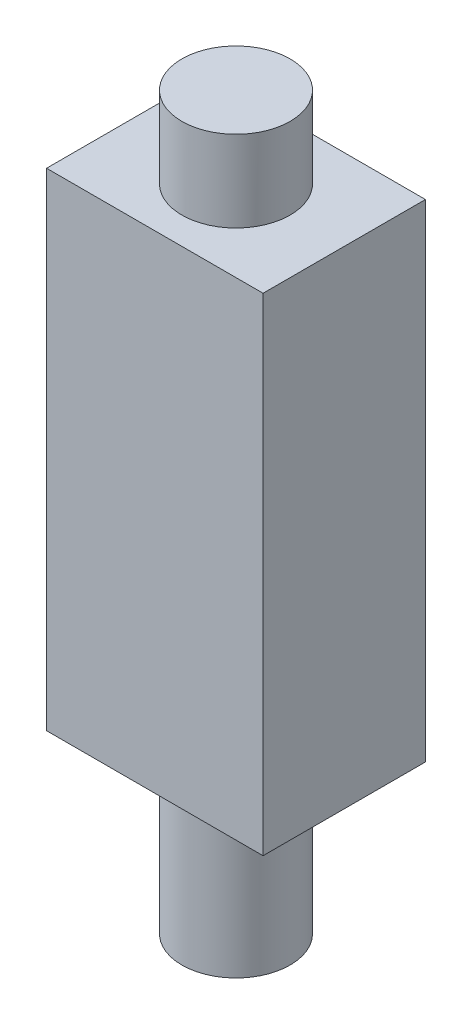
ISO-10303-21;
HEADER;
FILE_DESCRIPTION(('STEP AP214'),'2;1');
FILE_NAME('part.step','',(''),(''),'','','');
FILE_SCHEMA(('AUTOMOTIVE_DESIGN { 1 0 10303 214 1 1 1 1 }'));
ENDSEC;
DATA;
#1=APPLICATION_CONTEXT('core data for automotive mechanical design processes');
#2=APPLICATION_PROTOCOL_DEFINITION('international standard','automotive_design',2000,#1);
#3=PRODUCT_CONTEXT('',#1,'mechanical');
#4=PRODUCT('Part','Part','',(#3));
#5=PRODUCT_RELATED_PRODUCT_CATEGORY('part','',(#4));
#6=PRODUCT_DEFINITION_FORMATION('','',#4);
#7=PRODUCT_DEFINITION_CONTEXT('part definition',#1,'design');
#8=PRODUCT_DEFINITION('design','',#6,#7);
#9=PRODUCT_DEFINITION_SHAPE('','',#8);
#10=(LENGTH_UNIT() NAMED_UNIT(*) SI_UNIT(.MILLI.,.METRE.));
#11=(NAMED_UNIT(*) PLANE_ANGLE_UNIT() SI_UNIT($,.RADIAN.));
#12=(NAMED_UNIT(*) SI_UNIT($,.STERADIAN.) SOLID_ANGLE_UNIT());
#13=UNCERTAINTY_MEASURE_WITH_UNIT(LENGTH_MEASURE(1.E-05),#10,'distance_accuracy_value','');
#14=(GEOMETRIC_REPRESENTATION_CONTEXT(3) GLOBAL_UNCERTAINTY_ASSIGNED_CONTEXT((#13)) GLOBAL_UNIT_ASSIGNED_CONTEXT((#10,
#11,#12)) REPRESENTATION_CONTEXT('',''));
#15=CARTESIAN_POINT('',(0.,0.,0.));
#16=DIRECTION('',(0.,0.,1.));
#17=DIRECTION('',(1.,0.,0.));
#18=AXIS2_PLACEMENT_3D('',#15,#16,#17);
#19=CARTESIAN_POINT('',(0.,12.,0.));
#20=DIRECTION('',(0.,-1.,0.));
#21=DIRECTION('',(0.,0.,-1.));
#22=AXIS2_PLACEMENT_3D('',#19,#20,#21);
#23=PLANE('',#22);
#24=DIRECTION('',(0.,0.,-1.));
#25=VECTOR('',#24,1.);
#26=CARTESIAN_POINT('',(2.,12.,1.5));
#27=LINE('',#26,#25);
#28=CARTESIAN_POINT('',(2.,12.,1.5));
#29=VERTEX_POINT('',#28);
#30=CARTESIAN_POINT('',(2.,12.,-1.5));
#31=VERTEX_POINT('',#30);
#32=EDGE_CURVE('E88',#29,#31,#27,.T.);
#33=ORIENTED_EDGE('',*,*,#32,.T.);
#34=DIRECTION('',(-1.,0.,0.));
#35=VECTOR('',#34,1.);
#36=CARTESIAN_POINT('',(-2.,12.,-1.5));
#37=LINE('',#36,#35);
#38=CARTESIAN_POINT('',(-2.,12.,-1.5));
#39=VERTEX_POINT('',#38);
#40=EDGE_CURVE('E83',#31,#39,#37,.T.);
#41=ORIENTED_EDGE('',*,*,#40,.T.);
#42=DIRECTION('',(0.,0.,1.));
#43=VECTOR('',#42,1.);
#44=CARTESIAN_POINT('',(-2.,12.,1.5));
#45=LINE('',#44,#43);
#46=CARTESIAN_POINT('',(-2.,12.,1.5));
#47=VERTEX_POINT('',#46);
#48=EDGE_CURVE('E86',#39,#47,#45,.T.);
#49=ORIENTED_EDGE('',*,*,#48,.T.);
#50=DIRECTION('',(1.,0.,0.));
#51=VECTOR('',#50,1.);
#52=CARTESIAN_POINT('',(-2.,12.,1.5));
#53=LINE('',#52,#51);
#54=EDGE_CURVE('E52',#47,#29,#53,.T.);
#55=ORIENTED_EDGE('',*,*,#54,.T.);
#56=EDGE_LOOP('',(#33,#41,#49,#55));
#57=FACE_BOUND('',#56,.T.);
#58=CARTESIAN_POINT('',(0.,12.,0.));
#59=DIRECTION('',(0.,-1.,0.));
#60=DIRECTION('',(0.,0.,-1.));
#61=AXIS2_PLACEMENT_3D('',#58,#59,#60);
#62=CIRCLE('',#61,1.);
#63=CARTESIAN_POINT('',(0.,12.,-1.));
#64=VERTEX_POINT('',#63);
#65=EDGE_CURVE('E11',#64,#64,#62,.F.);
#66=ORIENTED_EDGE('',*,*,#65,.F.);
#67=EDGE_LOOP('',(#66));
#68=FACE_BOUND('',#67,.T.);
#69=ADVANCED_FACE('F35',(#57,#68),#23,.F.);
#70=CARTESIAN_POINT('',(0.,3.,0.));
#71=DIRECTION('',(0.,-1.,0.));
#72=DIRECTION('',(0.,0.,-1.));
#73=AXIS2_PLACEMENT_3D('',#70,#71,#72);
#74=CYLINDRICAL_SURFACE('',#73,1.);
#75=CARTESIAN_POINT('',(0.,3.,0.));
#76=DIRECTION('',(0.,1.,0.));
#77=DIRECTION('',(0.,0.,1.));
#78=AXIS2_PLACEMENT_3D('',#75,#76,#77);
#79=CIRCLE('',#78,1.);
#80=CARTESIAN_POINT('',(0.,3.,1.));
#81=VERTEX_POINT('',#80);
#82=EDGE_CURVE('E44',#81,#81,#79,.T.);
#83=ORIENTED_EDGE('',*,*,#82,.F.);
#84=EDGE_LOOP('',(#83));
#85=FACE_BOUND('',#84,.T.);
#86=CARTESIAN_POINT('',(0.,0.,0.));
#87=DIRECTION('',(0.,1.,0.));
#88=DIRECTION('',(0.,0.,1.));
#89=AXIS2_PLACEMENT_3D('',#86,#87,#88);
#90=CIRCLE('',#89,1.);
#91=CARTESIAN_POINT('',(0.,0.,1.));
#92=VERTEX_POINT('',#91);
#93=EDGE_CURVE('E113',#92,#92,#90,.T.);
#94=ORIENTED_EDGE('',*,*,#93,.T.);
#95=EDGE_LOOP('',(#94));
#96=FACE_BOUND('',#95,.T.);
#97=ADVANCED_FACE('F37',(#85,#96),#74,.T.);
#98=CARTESIAN_POINT('',(0.,0.,0.));
#99=DIRECTION('',(0.,1.,0.));
#100=DIRECTION('',(0.,0.,1.));
#101=AXIS2_PLACEMENT_3D('',#98,#99,#100);
#102=PLANE('',#101);
#103=ORIENTED_EDGE('',*,*,#93,.F.);
#104=EDGE_LOOP('',(#103));
#105=FACE_BOUND('',#104,.T.);
#106=ADVANCED_FACE('F119',(#105),#102,.F.);
#107=CARTESIAN_POINT('',(0.,3.,0.));
#108=DIRECTION('',(0.,-1.,0.));
#109=DIRECTION('',(0.,0.,-1.));
#110=AXIS2_PLACEMENT_3D('',#107,#108,#109);
#111=PLANE('',#110);
#112=DIRECTION('',(0.,0.,-1.));
#113=VECTOR('',#112,1.);
#114=CARTESIAN_POINT('',(2.,3.,1.5));
#115=LINE('',#114,#113);
#116=CARTESIAN_POINT('',(2.,3.,1.5));
#117=VERTEX_POINT('',#116);
#118=CARTESIAN_POINT('',(2.,3.,-1.5));
#119=VERTEX_POINT('',#118);
#120=EDGE_CURVE('E103',#117,#119,#115,.T.);
#121=ORIENTED_EDGE('',*,*,#120,.F.);
#122=DIRECTION('',(1.,0.,0.));
#123=VECTOR('',#122,1.);
#124=CARTESIAN_POINT('',(-2.,3.,1.5));
#125=LINE('',#124,#123);
#126=CARTESIAN_POINT('',(-2.,3.,1.5));
#127=VERTEX_POINT('',#126);
#128=EDGE_CURVE('E75',#127,#117,#125,.T.);
#129=ORIENTED_EDGE('',*,*,#128,.F.);
#130=DIRECTION('',(0.,0.,1.));
#131=VECTOR('',#130,1.);
#132=CARTESIAN_POINT('',(-2.,3.,1.5));
#133=LINE('',#132,#131);
#134=CARTESIAN_POINT('',(-2.,3.,-1.5));
#135=VERTEX_POINT('',#134);
#136=EDGE_CURVE('E69',#135,#127,#133,.T.);
#137=ORIENTED_EDGE('',*,*,#136,.F.);
#138=DIRECTION('',(-1.,0.,0.));
#139=VECTOR('',#138,1.);
#140=CARTESIAN_POINT('',(-2.,3.,-1.5));
#141=LINE('',#140,#139);
#142=EDGE_CURVE('E93',#119,#135,#141,.T.);
#143=ORIENTED_EDGE('',*,*,#142,.F.);
#144=EDGE_LOOP('',(#121,#129,#137,#143));
#145=FACE_BOUND('',#144,.T.);
#146=ORIENTED_EDGE('',*,*,#82,.T.);
#147=EDGE_LOOP('',(#146));
#148=FACE_BOUND('',#147,.T.);
#149=ADVANCED_FACE('F121',(#145,#148),#111,.T.);
#150=CARTESIAN_POINT('',(2.,12.,1.5));
#151=DIRECTION('',(-1.,0.,0.));
#152=DIRECTION('',(0.,0.,1.));
#153=AXIS2_PLACEMENT_3D('',#150,#151,#152);
#154=PLANE('',#153);
#155=ORIENTED_EDGE('',*,*,#120,.T.);
#156=DIRECTION('',(0.,-1.,0.));
#157=VECTOR('',#156,1.);
#158=CARTESIAN_POINT('',(2.,12.,-1.5));
#159=LINE('',#158,#157);
#160=EDGE_CURVE('E94',#31,#119,#159,.T.);
#161=ORIENTED_EDGE('',*,*,#160,.F.);
#162=ORIENTED_EDGE('',*,*,#32,.F.);
#163=DIRECTION('',(0.,-1.,0.));
#164=VECTOR('',#163,1.);
#165=CARTESIAN_POINT('',(2.,12.,1.5));
#166=LINE('',#165,#164);
#167=EDGE_CURVE('E99',#29,#117,#166,.T.);
#168=ORIENTED_EDGE('',*,*,#167,.T.);
#169=EDGE_LOOP('',(#155,#161,#162,#168));
#170=FACE_BOUND('',#169,.T.);
#171=ADVANCED_FACE('F126',(#170),#154,.F.);
#172=CARTESIAN_POINT('',(-2.,12.,-1.5));
#173=DIRECTION('',(0.,0.,1.));
#174=DIRECTION('',(1.,0.,0.));
#175=AXIS2_PLACEMENT_3D('',#172,#173,#174);
#176=PLANE('',#175);
#177=ORIENTED_EDGE('',*,*,#142,.T.);
#178=DIRECTION('',(0.,-1.,0.));
#179=VECTOR('',#178,1.);
#180=CARTESIAN_POINT('',(-2.,12.,-1.5));
#181=LINE('',#180,#179);
#182=EDGE_CURVE('E91',#39,#135,#181,.T.);
#183=ORIENTED_EDGE('',*,*,#182,.F.);
#184=ORIENTED_EDGE('',*,*,#40,.F.);
#185=ORIENTED_EDGE('',*,*,#160,.T.);
#186=EDGE_LOOP('',(#177,#183,#184,#185));
#187=FACE_BOUND('',#186,.T.);
#188=ADVANCED_FACE('F92',(#187),#176,.F.);
#189=CARTESIAN_POINT('',(-2.,12.,1.5));
#190=DIRECTION('',(1.,0.,0.));
#191=DIRECTION('',(0.,0.,-1.));
#192=AXIS2_PLACEMENT_3D('',#189,#190,#191);
#193=PLANE('',#192);
#194=ORIENTED_EDGE('',*,*,#136,.T.);
#195=DIRECTION('',(0.,-1.,0.));
#196=VECTOR('',#195,1.);
#197=CARTESIAN_POINT('',(-2.,12.,1.5));
#198=LINE('',#197,#196);
#199=EDGE_CURVE('E95',#47,#127,#198,.T.);
#200=ORIENTED_EDGE('',*,*,#199,.F.);
#201=ORIENTED_EDGE('',*,*,#48,.F.);
#202=ORIENTED_EDGE('',*,*,#182,.T.);
#203=EDGE_LOOP('',(#194,#200,#201,#202));
#204=FACE_BOUND('',#203,.T.);
#205=ADVANCED_FACE('F97',(#204),#193,.F.);
#206=CARTESIAN_POINT('',(-2.,12.,1.5));
#207=DIRECTION('',(0.,0.,-1.));
#208=DIRECTION('',(-1.,0.,0.));
#209=AXIS2_PLACEMENT_3D('',#206,#207,#208);
#210=PLANE('',#209);
#211=ORIENTED_EDGE('',*,*,#128,.T.);
#212=ORIENTED_EDGE('',*,*,#167,.F.);
#213=ORIENTED_EDGE('',*,*,#54,.F.);
#214=ORIENTED_EDGE('',*,*,#199,.T.);
#215=EDGE_LOOP('',(#211,#212,#213,#214));
#216=FACE_BOUND('',#215,.T.);
#217=ADVANCED_FACE('F139',(#216),#210,.F.);
#218=CARTESIAN_POINT('',(0.,13.5,0.));
#219=DIRECTION('',(0.,-1.,0.));
#220=DIRECTION('',(0.,0.,-1.));
#221=AXIS2_PLACEMENT_3D('',#218,#219,#220);
#222=CYLINDRICAL_SURFACE('',#221,1.);
#223=CARTESIAN_POINT('',(0.,13.5,0.));
#224=DIRECTION('',(0.,1.,0.));
#225=DIRECTION('',(0.,0.,1.));
#226=AXIS2_PLACEMENT_3D('',#223,#224,#225);
#227=CIRCLE('',#226,1.);
#228=CARTESIAN_POINT('',(0.,13.5,1.));
#229=VERTEX_POINT('',#228);
#230=EDGE_CURVE('E106',#229,#229,#227,.T.);
#231=ORIENTED_EDGE('',*,*,#230,.F.);
#232=EDGE_LOOP('',(#231));
#233=FACE_BOUND('',#232,.T.);
#234=ORIENTED_EDGE('',*,*,#65,.T.);
#235=EDGE_LOOP('',(#234));
#236=FACE_BOUND('',#235,.T.);
#237=ADVANCED_FACE('F136',(#233,#236),#222,.T.);
#238=CARTESIAN_POINT('',(0.,13.5,0.));
#239=DIRECTION('',(0.,1.,0.));
#240=DIRECTION('',(0.,0.,1.));
#241=AXIS2_PLACEMENT_3D('',#238,#239,#240);
#242=PLANE('',#241);
#243=ORIENTED_EDGE('',*,*,#230,.T.);
#244=EDGE_LOOP('',(#243));
#245=FACE_BOUND('',#244,.T.);
#246=ADVANCED_FACE('F156',(#245),#242,.T.);
#247=CLOSED_SHELL('',(#69,#97,#106,#149,#171,#188,#205,#217,#237,#246));
#248=MANIFOLD_SOLID_BREP('B2',#247);
#249=ADVANCED_BREP_SHAPE_REPRESENTATION('',(#18,#248),#14);
#250=SHAPE_DEFINITION_REPRESENTATION(#9,#249);
ENDSEC;
END-ISO-10303-21;
